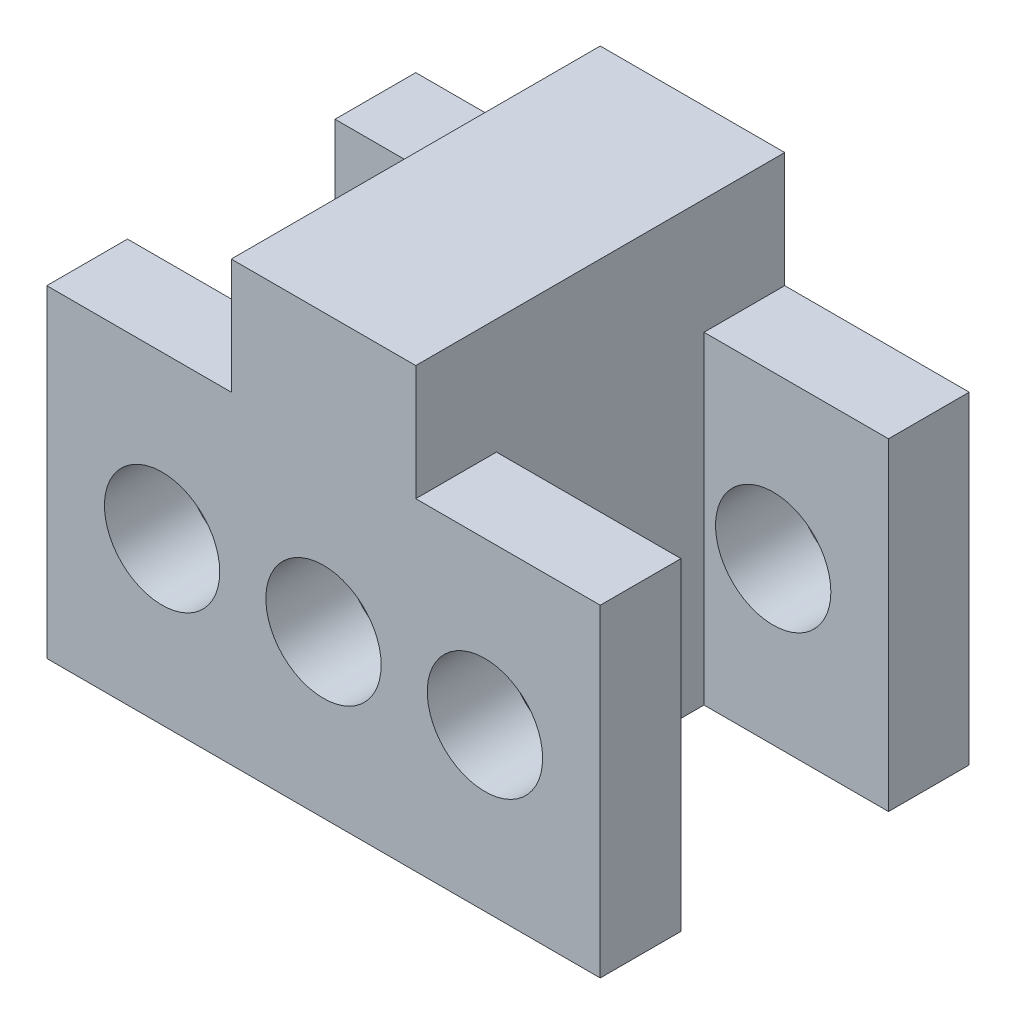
from build123d import *

# Parameters (mm, degrees)
SKETCH_2_W      = 32
SKETCH_2_H      = 20
EXTRUDE_1_DEPTH = 32
SKETCH_3_W      = 96
SKETCH_3_H      = 56
SKETCH_3_R      = 10
EXTRUDE_2_DEPTH = 14
EXTRUDE_3_REACH = 97.415
SKETCH_4_W      = 32
SKETCH_4_H      = 36


with BuildPart() as part:
    # Sketch 2 → Extrude 1 (new, symmetric)
    with BuildSketch(Plane.XY):
        with Locations((0, 38)):
            Rectangle(SKETCH_2_W, SKETCH_2_H)
    extrude(amount=EXTRUDE_1_DEPTH, both=True)

    # Sketch 3 → Extrude 2 (add)
    with BuildSketch(Plane.XY.offset(32)):
        Rectangle(SKETCH_3_W, SKETCH_3_H)
        Circle(SKETCH_3_R, mode=Mode.SUBTRACT)
        with Locations((-28, 0)):
            Circle(SKETCH_3_R, mode=Mode.SUBTRACT)
        with Locations((28, 0)):
            Circle(SKETCH_3_R, mode=Mode.SUBTRACT)
    extrude_2 = extrude(amount=-EXTRUDE_2_DEPTH)

    # Mirror 1: Extrude 2 across plane
    add(extrude_2.mirror(Plane.XY))

    # Sketch 4 → Extrude 3 (add, up to next)
    with BuildSketch(Plane.XZ.offset(28), mode=Mode.PRIVATE) as extrude_3_sk1:
        Rectangle(SKETCH_4_W, SKETCH_4_H)
    extrude_3_tool1 = extrude(extrude_3_sk1.sketch, amount=-EXTRUDE_3_REACH, mode=Mode.PRIVATE) - part.part
    add(extrude_3_tool1.solids().sort_by_distance((0, -28, 0))[0])


solid = part.part
